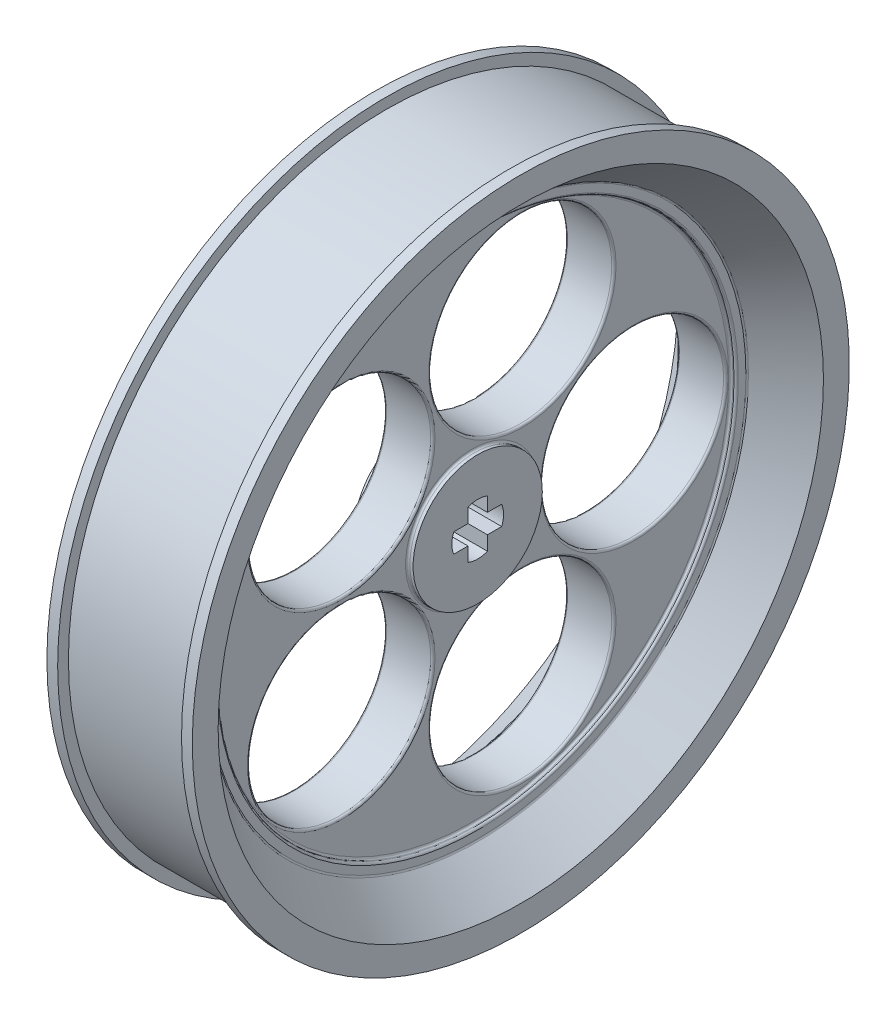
ISO-10303-21;
HEADER;
FILE_DESCRIPTION(('STEP AP214'),'2;1');
FILE_NAME('part.step','',(''),(''),'','','');
FILE_SCHEMA(('AUTOMOTIVE_DESIGN { 1 0 10303 214 1 1 1 1 }'));
ENDSEC;
DATA;
#1=APPLICATION_CONTEXT('core data for automotive mechanical design processes');
#2=APPLICATION_PROTOCOL_DEFINITION('international standard','automotive_design',2000,#1);
#3=PRODUCT_CONTEXT('',#1,'mechanical');
#4=PRODUCT('Part','Part','',(#3));
#5=PRODUCT_RELATED_PRODUCT_CATEGORY('part','',(#4));
#6=PRODUCT_DEFINITION_FORMATION('','',#4);
#7=PRODUCT_DEFINITION_CONTEXT('part definition',#1,'design');
#8=PRODUCT_DEFINITION('design','',#6,#7);
#9=PRODUCT_DEFINITION_SHAPE('','',#8);
#10=(LENGTH_UNIT() NAMED_UNIT(*) SI_UNIT(.MILLI.,.METRE.));
#11=(NAMED_UNIT(*) PLANE_ANGLE_UNIT() SI_UNIT($,.RADIAN.));
#12=(NAMED_UNIT(*) SI_UNIT($,.STERADIAN.) SOLID_ANGLE_UNIT());
#13=UNCERTAINTY_MEASURE_WITH_UNIT(LENGTH_MEASURE(1.E-05),#10,'distance_accuracy_value','');
#14=(GEOMETRIC_REPRESENTATION_CONTEXT(3) GLOBAL_UNCERTAINTY_ASSIGNED_CONTEXT((#13)) GLOBAL_UNIT_ASSIGNED_CONTEXT((#10,
#11,#12)) REPRESENTATION_CONTEXT('',''));
#15=CARTESIAN_POINT('',(0.,0.,0.));
#16=DIRECTION('',(0.,0.,1.));
#17=DIRECTION('',(1.,0.,0.));
#18=AXIS2_PLACEMENT_3D('',#15,#16,#17);
#19=CARTESIAN_POINT('',(2.75,25.,0.));
#20=DIRECTION('',(-1.,0.,0.));
#21=DIRECTION('',(0.,0.,1.));
#22=AXIS2_PLACEMENT_3D('',#19,#20,#21);
#23=PLANE('',#22);
#24=DIRECTION('',(0.,0.,-1.));
#25=VECTOR('',#24,1.);
#26=CARTESIAN_POINT('',(2.75,-0.9,2.2248595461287));
#27=LINE('',#26,#25);
#28=CARTESIAN_POINT('',(2.75,-0.900000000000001,2.2248595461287));
#29=VERTEX_POINT('',#28);
#30=CARTESIAN_POINT('',(2.75,-0.9,0.899999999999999));
#31=VERTEX_POINT('',#30);
#32=EDGE_CURVE('E137',#29,#31,#27,.T.);
#33=ORIENTED_EDGE('',*,*,#32,.F.);
#34=CARTESIAN_POINT('',(2.75,0.,0.));
#35=DIRECTION('',(1.,0.,0.));
#36=DIRECTION('',(0.,0.,-1.));
#37=AXIS2_PLACEMENT_3D('',#34,#35,#36);
#38=CIRCLE('',#37,2.4);
#39=CARTESIAN_POINT('',(2.75,0.9,2.2248595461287));
#40=VERTEX_POINT('',#39);
#41=EDGE_CURVE('E59',#40,#29,#38,.T.);
#42=ORIENTED_EDGE('',*,*,#41,.F.);
#43=DIRECTION('',(0.,0.,1.));
#44=VECTOR('',#43,1.);
#45=CARTESIAN_POINT('',(2.75,0.9,2.2248595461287));
#46=LINE('',#45,#44);
#47=CARTESIAN_POINT('',(2.75,0.9,0.899999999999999));
#48=VERTEX_POINT('',#47);
#49=EDGE_CURVE('E170',#48,#40,#46,.T.);
#50=ORIENTED_EDGE('',*,*,#49,.F.);
#51=DIRECTION('',(0.,-1.,0.));
#52=VECTOR('',#51,1.);
#53=CARTESIAN_POINT('',(2.75,2.2248595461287,0.9));
#54=LINE('',#53,#52);
#55=CARTESIAN_POINT('',(2.75,2.2248595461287,0.9));
#56=VERTEX_POINT('',#55);
#57=EDGE_CURVE('E167',#56,#48,#54,.T.);
#58=ORIENTED_EDGE('',*,*,#57,.F.);
#59=CARTESIAN_POINT('',(2.75,0.,0.));
#60=DIRECTION('',(1.,0.,0.));
#61=DIRECTION('',(0.,0.,-1.));
#62=AXIS2_PLACEMENT_3D('',#59,#60,#61);
#63=CIRCLE('',#62,2.4);
#64=CARTESIAN_POINT('',(2.75,2.2248595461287,-0.9));
#65=VERTEX_POINT('',#64);
#66=EDGE_CURVE('E164',#65,#56,#63,.T.);
#67=ORIENTED_EDGE('',*,*,#66,.F.);
#68=DIRECTION('',(0.,1.,0.));
#69=VECTOR('',#68,1.);
#70=CARTESIAN_POINT('',(2.75,2.2248595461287,-0.9));
#71=LINE('',#70,#69);
#72=CARTESIAN_POINT('',(2.75,0.9,-0.9));
#73=VERTEX_POINT('',#72);
#74=EDGE_CURVE('E161',#73,#65,#71,.T.);
#75=ORIENTED_EDGE('',*,*,#74,.F.);
#76=DIRECTION('',(0.,0.,1.));
#77=VECTOR('',#76,1.);
#78=CARTESIAN_POINT('',(2.75,0.9,-0.9));
#79=LINE('',#78,#77);
#80=CARTESIAN_POINT('',(2.75,0.9,-2.2248595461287));
#81=VERTEX_POINT('',#80);
#82=EDGE_CURVE('E158',#81,#73,#79,.T.);
#83=ORIENTED_EDGE('',*,*,#82,.F.);
#84=CARTESIAN_POINT('',(2.75,0.,0.));
#85=DIRECTION('',(1.,0.,0.));
#86=DIRECTION('',(0.,0.,-1.));
#87=AXIS2_PLACEMENT_3D('',#84,#85,#86);
#88=CIRCLE('',#87,2.4);
#89=CARTESIAN_POINT('',(2.75,-0.9,-2.2248595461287));
#90=VERTEX_POINT('',#89);
#91=EDGE_CURVE('E155',#90,#81,#88,.T.);
#92=ORIENTED_EDGE('',*,*,#91,.F.);
#93=DIRECTION('',(0.,0.,-1.));
#94=VECTOR('',#93,1.);
#95=CARTESIAN_POINT('',(2.75,-0.9,-0.9));
#96=LINE('',#95,#94);
#97=CARTESIAN_POINT('',(2.75,-0.9,-0.9));
#98=VERTEX_POINT('',#97);
#99=EDGE_CURVE('E152',#98,#90,#96,.T.);
#100=ORIENTED_EDGE('',*,*,#99,.F.);
#101=DIRECTION('',(0.,1.,0.));
#102=VECTOR('',#101,1.);
#103=CARTESIAN_POINT('',(2.75,-0.9,-0.9));
#104=LINE('',#103,#102);
#105=CARTESIAN_POINT('',(2.75,-2.2248595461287,-0.900000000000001));
#106=VERTEX_POINT('',#105);
#107=EDGE_CURVE('E146',#106,#98,#104,.T.);
#108=ORIENTED_EDGE('',*,*,#107,.F.);
#109=CARTESIAN_POINT('',(2.75,0.,0.));
#110=DIRECTION('',(1.,0.,0.));
#111=DIRECTION('',(0.,0.,-1.));
#112=AXIS2_PLACEMENT_3D('',#109,#110,#111);
#113=CIRCLE('',#112,2.4);
#114=CARTESIAN_POINT('',(2.75,-2.2248595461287,0.899999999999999));
#115=VERTEX_POINT('',#114);
#116=EDGE_CURVE('E144',#115,#106,#113,.T.);
#117=ORIENTED_EDGE('',*,*,#116,.F.);
#118=DIRECTION('',(0.,-1.,0.));
#119=VECTOR('',#118,1.);
#120=CARTESIAN_POINT('',(2.75,-0.9,0.899999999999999));
#121=LINE('',#120,#119);
#122=EDGE_CURVE('E128',#31,#115,#121,.T.);
#123=ORIENTED_EDGE('',*,*,#122,.F.);
#124=EDGE_LOOP('',(#33,#42,#50,#58,#67,#75,#83,#92,#100,#108,#117,#123));
#125=FACE_BOUND('',#124,.T.);
#126=CARTESIAN_POINT('',(2.75,0.,0.));
#127=DIRECTION('',(1.,0.,0.));
#128=DIRECTION('',(0.,0.,-1.));
#129=AXIS2_PLACEMENT_3D('',#126,#127,#128);
#130=CIRCLE('',#129,6.);
#131=CARTESIAN_POINT('',(2.75,0.,-6.));
#132=VERTEX_POINT('',#131);
#133=EDGE_CURVE('E898',#132,#132,#130,.T.);
#134=ORIENTED_EDGE('',*,*,#133,.T.);
#135=EDGE_LOOP('',(#134));
#136=FACE_BOUND('',#135,.T.);
#137=ADVANCED_FACE('F36',(#125,#136),#23,.F.);
#138=CARTESIAN_POINT('',(-2.75,0.,0.));
#139=DIRECTION('',(1.,0.,0.));
#140=DIRECTION('',(0.,0.,-1.));
#141=AXIS2_PLACEMENT_3D('',#138,#139,#140);
#142=PLANE('',#141);
#143=DIRECTION('',(0.,0.,1.));
#144=VECTOR('',#143,1.);
#145=CARTESIAN_POINT('',(-2.75,0.9,0.));
#146=LINE('',#145,#144);
#147=CARTESIAN_POINT('',(-2.75,0.9,0.899999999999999));
#148=VERTEX_POINT('',#147);
#149=CARTESIAN_POINT('',(-2.75,0.9,2.2248595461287));
#150=VERTEX_POINT('',#149);
#151=EDGE_CURVE('E220',#148,#150,#146,.T.);
#152=ORIENTED_EDGE('',*,*,#151,.T.);
#153=CARTESIAN_POINT('',(-2.75,0.,0.));
#154=DIRECTION('',(1.,0.,0.));
#155=DIRECTION('',(0.,0.,-1.));
#156=AXIS2_PLACEMENT_3D('',#153,#154,#155);
#157=CIRCLE('',#156,2.4);
#158=CARTESIAN_POINT('',(-2.75,-0.9,2.2248595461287));
#159=VERTEX_POINT('',#158);
#160=EDGE_CURVE('E223',#150,#159,#157,.T.);
#161=ORIENTED_EDGE('',*,*,#160,.T.);
#162=DIRECTION('',(0.,0.,-1.));
#163=VECTOR('',#162,1.);
#164=CARTESIAN_POINT('',(-2.75,-0.9,0.));
#165=LINE('',#164,#163);
#166=CARTESIAN_POINT('',(-2.75,-0.9,0.899999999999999));
#167=VERTEX_POINT('',#166);
#168=EDGE_CURVE('E175',#159,#167,#165,.T.);
#169=ORIENTED_EDGE('',*,*,#168,.T.);
#170=DIRECTION('',(0.,-1.,0.));
#171=VECTOR('',#170,1.);
#172=CARTESIAN_POINT('',(-2.75,0.,0.899999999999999));
#173=LINE('',#172,#171);
#174=CARTESIAN_POINT('',(-2.75,-2.2248595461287,0.899999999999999));
#175=VERTEX_POINT('',#174);
#176=EDGE_CURVE('E131',#167,#175,#173,.T.);
#177=ORIENTED_EDGE('',*,*,#176,.T.);
#178=CARTESIAN_POINT('',(-2.75,0.,0.));
#179=DIRECTION('',(1.,0.,0.));
#180=DIRECTION('',(0.,0.,-1.));
#181=AXIS2_PLACEMENT_3D('',#178,#179,#180);
#182=CIRCLE('',#181,2.4);
#183=CARTESIAN_POINT('',(-2.75,-2.2248595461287,-0.900000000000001));
#184=VERTEX_POINT('',#183);
#185=EDGE_CURVE('E196',#175,#184,#182,.T.);
#186=ORIENTED_EDGE('',*,*,#185,.T.);
#187=DIRECTION('',(0.,1.,0.));
#188=VECTOR('',#187,1.);
#189=CARTESIAN_POINT('',(-2.75,0.,-0.9));
#190=LINE('',#189,#188);
#191=CARTESIAN_POINT('',(-2.75,-0.9,-0.9));
#192=VERTEX_POINT('',#191);
#193=EDGE_CURVE('E199',#184,#192,#190,.T.);
#194=ORIENTED_EDGE('',*,*,#193,.T.);
#195=DIRECTION('',(0.,0.,-1.));
#196=VECTOR('',#195,1.);
#197=CARTESIAN_POINT('',(-2.75,-0.9,0.));
#198=LINE('',#197,#196);
#199=CARTESIAN_POINT('',(-2.75,-0.9,-2.2248595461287));
#200=VERTEX_POINT('',#199);
#201=EDGE_CURVE('E202',#192,#200,#198,.T.);
#202=ORIENTED_EDGE('',*,*,#201,.T.);
#203=CARTESIAN_POINT('',(-2.75,0.,0.));
#204=DIRECTION('',(1.,0.,0.));
#205=DIRECTION('',(0.,0.,-1.));
#206=AXIS2_PLACEMENT_3D('',#203,#204,#205);
#207=CIRCLE('',#206,2.4);
#208=CARTESIAN_POINT('',(-2.75,0.9,-2.2248595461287));
#209=VERTEX_POINT('',#208);
#210=EDGE_CURVE('E205',#200,#209,#207,.T.);
#211=ORIENTED_EDGE('',*,*,#210,.T.);
#212=DIRECTION('',(0.,0.,1.));
#213=VECTOR('',#212,1.);
#214=CARTESIAN_POINT('',(-2.75,0.9,0.));
#215=LINE('',#214,#213);
#216=CARTESIAN_POINT('',(-2.75,0.9,-0.9));
#217=VERTEX_POINT('',#216);
#218=EDGE_CURVE('E208',#209,#217,#215,.T.);
#219=ORIENTED_EDGE('',*,*,#218,.T.);
#220=DIRECTION('',(0.,1.,0.));
#221=VECTOR('',#220,1.);
#222=CARTESIAN_POINT('',(-2.75,0.,-0.9));
#223=LINE('',#222,#221);
#224=CARTESIAN_POINT('',(-2.75,2.2248595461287,-0.9));
#225=VERTEX_POINT('',#224);
#226=EDGE_CURVE('E211',#217,#225,#223,.T.);
#227=ORIENTED_EDGE('',*,*,#226,.T.);
#228=CARTESIAN_POINT('',(-2.75,0.,0.));
#229=DIRECTION('',(1.,0.,0.));
#230=DIRECTION('',(0.,0.,-1.));
#231=AXIS2_PLACEMENT_3D('',#228,#229,#230);
#232=CIRCLE('',#231,2.4);
#233=CARTESIAN_POINT('',(-2.75,2.2248595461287,0.9));
#234=VERTEX_POINT('',#233);
#235=EDGE_CURVE('E214',#225,#234,#232,.T.);
#236=ORIENTED_EDGE('',*,*,#235,.T.);
#237=DIRECTION('',(0.,-1.,0.));
#238=VECTOR('',#237,1.);
#239=CARTESIAN_POINT('',(-2.75,0.,0.899999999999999));
#240=LINE('',#239,#238);
#241=EDGE_CURVE('E217',#234,#148,#240,.T.);
#242=ORIENTED_EDGE('',*,*,#241,.T.);
#243=EDGE_LOOP('',(#152,#161,#169,#177,#186,#194,#202,#211,#219,#227,#236,#242));
#244=FACE_BOUND('',#243,.T.);
#245=CARTESIAN_POINT('',(-2.75,0.,0.));
#246=DIRECTION('',(-1.,0.,0.));
#247=DIRECTION('',(0.,0.,1.));
#248=AXIS2_PLACEMENT_3D('',#245,#246,#247);
#249=CIRCLE('',#248,6.);
#250=CARTESIAN_POINT('',(-2.75,0.,6.));
#251=VERTEX_POINT('',#250);
#252=EDGE_CURVE('E894',#251,#251,#249,.T.);
#253=ORIENTED_EDGE('',*,*,#252,.T.);
#254=EDGE_LOOP('',(#253));
#255=FACE_BOUND('',#254,.T.);
#256=ADVANCED_FACE('F376',(#244,#255),#142,.F.);
#257=CARTESIAN_POINT('',(-2.75,0.,0.));
#258=DIRECTION('',(1.,0.,0.));
#259=DIRECTION('',(0.,0.,-1.));
#260=AXIS2_PLACEMENT_3D('',#257,#258,#259);
#261=CIRCLE('',#260,24.2);
#262=CARTESIAN_POINT('',(-2.75,0.,-24.2));
#263=VERTEX_POINT('',#262);
#264=EDGE_CURVE('E325',#263,#263,#261,.T.);
#265=ORIENTED_EDGE('',*,*,#264,.T.);
#266=EDGE_LOOP('',(#265));
#267=FACE_BOUND('',#266,.T.);
#268=CARTESIAN_POINT('',(-2.75,0.,0.));
#269=DIRECTION('',(1.,0.,0.));
#270=DIRECTION('',(0.,0.,-1.));
#271=AXIS2_PLACEMENT_3D('',#268,#269,#270);
#272=CIRCLE('',#271,24.9019683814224);
#273=CARTESIAN_POINT('',(-2.75,0.,-24.9019683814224));
#274=VERTEX_POINT('',#273);
#275=EDGE_CURVE('E322',#274,#274,#272,.F.);
#276=ORIENTED_EDGE('',*,*,#275,.T.);
#277=EDGE_LOOP('',(#276));
#278=FACE_BOUND('',#277,.T.);
#279=ADVANCED_FACE('F382',(#267,#278),#142,.F.);
#280=CARTESIAN_POINT('',(-6.75000000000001,0.,0.));
#281=DIRECTION('',(-1.,0.,0.));
#282=DIRECTION('',(0.,0.,1.));
#283=AXIS2_PLACEMENT_3D('',#280,#281,#282);
#284=CONICAL_SURFACE('',#283,28.1,0.659310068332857);
#285=CARTESIAN_POINT('',(-2.82748566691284,0.,0.));
#286=DIRECTION('',(-1.,0.,0.));
#287=DIRECTION('',(0.,0.,1.));
#288=AXIS2_PLACEMENT_3D('',#285,#286,#287);
#289=CIRCLE('',#288,25.0600513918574);
#290=CARTESIAN_POINT('',(-2.82748566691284,0.,25.0600513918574));
#291=VERTEX_POINT('',#290);
#292=EDGE_CURVE('E328',#291,#291,#289,.F.);
#293=ORIENTED_EDGE('',*,*,#292,.T.);
#294=EDGE_LOOP('',(#293));
#295=FACE_BOUND('',#294,.T.);
#296=CARTESIAN_POINT('',(-6.75000000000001,0.,0.));
#297=DIRECTION('',(-1.,0.,0.));
#298=DIRECTION('',(0.,0.,1.));
#299=AXIS2_PLACEMENT_3D('',#296,#297,#298);
#300=CIRCLE('',#299,28.1);
#301=CARTESIAN_POINT('',(-6.75000000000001,0.,28.1));
#302=VERTEX_POINT('',#301);
#303=EDGE_CURVE('E247',#302,#302,#300,.T.);
#304=ORIENTED_EDGE('',*,*,#303,.T.);
#305=EDGE_LOOP('',(#304));
#306=FACE_BOUND('',#305,.T.);
#307=ADVANCED_FACE('F441',(#295,#306),#284,.F.);
#308=CARTESIAN_POINT('',(-6.75,28.1,0.));
#309=DIRECTION('',(1.,0.,0.));
#310=DIRECTION('',(0.,0.,-1.));
#311=AXIS2_PLACEMENT_3D('',#308,#309,#310);
#312=PLANE('',#311);
#313=ORIENTED_EDGE('',*,*,#303,.F.);
#314=EDGE_LOOP('',(#313));
#315=FACE_BOUND('',#314,.T.);
#316=CARTESIAN_POINT('',(-6.75000000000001,0.,0.));
#317=DIRECTION('',(-1.,0.,0.));
#318=DIRECTION('',(0.,0.,1.));
#319=AXIS2_PLACEMENT_3D('',#316,#317,#318);
#320=CIRCLE('',#319,30.5);
#321=CARTESIAN_POINT('',(-6.75000000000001,0.,30.5));
#322=VERTEX_POINT('',#321);
#323=EDGE_CURVE('E244',#322,#322,#320,.T.);
#324=ORIENTED_EDGE('',*,*,#323,.T.);
#325=EDGE_LOOP('',(#324));
#326=FACE_BOUND('',#325,.T.);
#327=ADVANCED_FACE('F437',(#315,#326),#312,.F.);
#328=CARTESIAN_POINT('',(-106.362451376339,0.,0.));
#329=DIRECTION('',(-1.,0.,0.));
#330=DIRECTION('',(0.,0.,1.));
#331=AXIS2_PLACEMENT_3D('',#328,#329,#330);
#332=CYLINDRICAL_SURFACE('',#331,30.5);
#333=ORIENTED_EDGE('',*,*,#323,.F.);
#334=EDGE_LOOP('',(#333));
#335=FACE_BOUND('',#334,.T.);
#336=CARTESIAN_POINT('',(-5.75000000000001,0.,0.));
#337=DIRECTION('',(-1.,0.,0.));
#338=DIRECTION('',(0.,0.,1.));
#339=AXIS2_PLACEMENT_3D('',#336,#337,#338);
#340=CIRCLE('',#339,30.5);
#341=CARTESIAN_POINT('',(-5.75000000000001,0.,30.5));
#342=VERTEX_POINT('',#341);
#343=EDGE_CURVE('E241',#342,#342,#340,.T.);
#344=ORIENTED_EDGE('',*,*,#343,.T.);
#345=EDGE_LOOP('',(#344));
#346=FACE_BOUND('',#345,.T.);
#347=ADVANCED_FACE('F433',(#335,#346),#332,.T.);
#348=CARTESIAN_POINT('',(-5.75,30.5,0.));
#349=DIRECTION('',(-1.,0.,0.));
#350=DIRECTION('',(0.,0.,1.));
#351=AXIS2_PLACEMENT_3D('',#348,#349,#350);
#352=PLANE('',#351);
#353=ORIENTED_EDGE('',*,*,#343,.F.);
#354=EDGE_LOOP('',(#353));
#355=FACE_BOUND('',#354,.T.);
#356=CARTESIAN_POINT('',(-5.75000000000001,0.,0.));
#357=DIRECTION('',(-1.,0.,0.));
#358=DIRECTION('',(0.,0.,1.));
#359=AXIS2_PLACEMENT_3D('',#356,#357,#358);
#360=CIRCLE('',#359,29.5);
#361=CARTESIAN_POINT('',(-5.75000000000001,0.,29.5));
#362=VERTEX_POINT('',#361);
#363=EDGE_CURVE('E238',#362,#362,#360,.T.);
#364=ORIENTED_EDGE('',*,*,#363,.T.);
#365=EDGE_LOOP('',(#364));
#366=FACE_BOUND('',#365,.T.);
#367=ADVANCED_FACE('F429',(#355,#366),#352,.F.);
#368=CARTESIAN_POINT('',(-106.362451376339,0.,0.));
#369=DIRECTION('',(-1.,0.,0.));
#370=DIRECTION('',(0.,0.,1.));
#371=AXIS2_PLACEMENT_3D('',#368,#369,#370);
#372=CYLINDRICAL_SURFACE('',#371,29.5);
#373=ORIENTED_EDGE('',*,*,#363,.F.);
#374=EDGE_LOOP('',(#373));
#375=FACE_BOUND('',#374,.T.);
#376=CARTESIAN_POINT('',(5.74999999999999,0.,0.));
#377=DIRECTION('',(-1.,0.,0.));
#378=DIRECTION('',(0.,0.,1.));
#379=AXIS2_PLACEMENT_3D('',#376,#377,#378);
#380=CIRCLE('',#379,29.5);
#381=CARTESIAN_POINT('',(5.74999999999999,0.,29.5));
#382=VERTEX_POINT('',#381);
#383=EDGE_CURVE('E235',#382,#382,#380,.T.);
#384=ORIENTED_EDGE('',*,*,#383,.T.);
#385=EDGE_LOOP('',(#384));
#386=FACE_BOUND('',#385,.T.);
#387=ADVANCED_FACE('F425',(#375,#386),#372,.T.);
#388=CARTESIAN_POINT('',(5.75,29.5,0.));
#389=DIRECTION('',(1.,0.,0.));
#390=DIRECTION('',(0.,0.,-1.));
#391=AXIS2_PLACEMENT_3D('',#388,#389,#390);
#392=PLANE('',#391);
#393=ORIENTED_EDGE('',*,*,#383,.F.);
#394=EDGE_LOOP('',(#393));
#395=FACE_BOUND('',#394,.T.);
#396=CARTESIAN_POINT('',(5.74999999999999,0.,0.));
#397=DIRECTION('',(-1.,0.,0.));
#398=DIRECTION('',(0.,0.,1.));
#399=AXIS2_PLACEMENT_3D('',#396,#397,#398);
#400=CIRCLE('',#399,30.5);
#401=CARTESIAN_POINT('',(5.74999999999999,0.,30.5));
#402=VERTEX_POINT('',#401);
#403=EDGE_CURVE('E232',#402,#402,#400,.T.);
#404=ORIENTED_EDGE('',*,*,#403,.T.);
#405=EDGE_LOOP('',(#404));
#406=FACE_BOUND('',#405,.T.);
#407=ADVANCED_FACE('F418',(#395,#406),#392,.F.);
#408=CARTESIAN_POINT('',(-106.362451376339,0.,0.));
#409=DIRECTION('',(-1.,0.,0.));
#410=DIRECTION('',(0.,0.,1.));
#411=AXIS2_PLACEMENT_3D('',#408,#409,#410);
#412=CYLINDRICAL_SURFACE('',#411,30.5);
#413=ORIENTED_EDGE('',*,*,#403,.F.);
#414=EDGE_LOOP('',(#413));
#415=FACE_BOUND('',#414,.T.);
#416=CARTESIAN_POINT('',(6.74999999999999,0.,0.));
#417=DIRECTION('',(-1.,0.,0.));
#418=DIRECTION('',(0.,0.,1.));
#419=AXIS2_PLACEMENT_3D('',#416,#417,#418);
#420=CIRCLE('',#419,30.5);
#421=CARTESIAN_POINT('',(6.74999999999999,0.,30.5));
#422=VERTEX_POINT('',#421);
#423=EDGE_CURVE('E229',#422,#422,#420,.T.);
#424=ORIENTED_EDGE('',*,*,#423,.T.);
#425=EDGE_LOOP('',(#424));
#426=FACE_BOUND('',#425,.T.);
#427=ADVANCED_FACE('F412',(#415,#426),#412,.T.);
#428=CARTESIAN_POINT('',(6.75,30.5,0.));
#429=DIRECTION('',(-1.,0.,0.));
#430=DIRECTION('',(0.,0.,1.));
#431=AXIS2_PLACEMENT_3D('',#428,#429,#430);
#432=PLANE('',#431);
#433=ORIENTED_EDGE('',*,*,#423,.F.);
#434=EDGE_LOOP('',(#433));
#435=FACE_BOUND('',#434,.T.);
#436=CARTESIAN_POINT('',(6.74999999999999,0.,0.));
#437=DIRECTION('',(-1.,0.,0.));
#438=DIRECTION('',(0.,0.,1.));
#439=AXIS2_PLACEMENT_3D('',#436,#437,#438);
#440=CIRCLE('',#439,28.1);
#441=CARTESIAN_POINT('',(6.74999999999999,0.,28.1));
#442=VERTEX_POINT('',#441);
#443=EDGE_CURVE('E226',#442,#442,#440,.T.);
#444=ORIENTED_EDGE('',*,*,#443,.T.);
#445=EDGE_LOOP('',(#444));
#446=FACE_BOUND('',#445,.T.);
#447=ADVANCED_FACE('F396',(#435,#446),#432,.F.);
#448=CARTESIAN_POINT('',(2.75,0.,0.));
#449=DIRECTION('',(1.,0.,0.));
#450=DIRECTION('',(0.,0.,-1.));
#451=AXIS2_PLACEMENT_3D('',#448,#449,#450);
#452=CONICAL_SURFACE('',#451,25.,0.659310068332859);
#453=CARTESIAN_POINT('',(2.82748566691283,0.,0.));
#454=DIRECTION('',(1.,0.,0.));
#455=DIRECTION('',(0.,0.,-1.));
#456=AXIS2_PLACEMENT_3D('',#453,#454,#455);
#457=CIRCLE('',#456,25.0600513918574);
#458=CARTESIAN_POINT('',(2.82748566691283,0.,-25.0600513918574));
#459=VERTEX_POINT('',#458);
#460=EDGE_CURVE('E265',#459,#459,#457,.F.);
#461=ORIENTED_EDGE('',*,*,#460,.T.);
#462=EDGE_LOOP('',(#461));
#463=FACE_BOUND('',#462,.T.);
#464=ORIENTED_EDGE('',*,*,#443,.F.);
#465=EDGE_LOOP('',(#464));
#466=FACE_BOUND('',#465,.T.);
#467=ADVANCED_FACE('F389',(#463,#466),#452,.F.);
#468=CARTESIAN_POINT('',(2.75,0.,0.));
#469=DIRECTION('',(-1.,0.,0.));
#470=DIRECTION('',(0.,0.,1.));
#471=AXIS2_PLACEMENT_3D('',#468,#469,#470);
#472=CIRCLE('',#471,24.2);
#473=CARTESIAN_POINT('',(2.75,0.,24.2));
#474=VERTEX_POINT('',#473);
#475=EDGE_CURVE('E259',#474,#474,#472,.T.);
#476=ORIENTED_EDGE('',*,*,#475,.T.);
#477=EDGE_LOOP('',(#476));
#478=FACE_BOUND('',#477,.T.);
#479=CARTESIAN_POINT('',(2.75,0.,0.));
#480=DIRECTION('',(-1.,0.,0.));
#481=DIRECTION('',(0.,0.,1.));
#482=AXIS2_PLACEMENT_3D('',#479,#480,#481);
#483=CIRCLE('',#482,24.9019683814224);
#484=CARTESIAN_POINT('',(2.75,0.,24.9019683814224));
#485=VERTEX_POINT('',#484);
#486=EDGE_CURVE('E256',#485,#485,#483,.F.);
#487=ORIENTED_EDGE('',*,*,#486,.T.);
#488=EDGE_LOOP('',(#487));
#489=FACE_BOUND('',#488,.T.);
#490=ADVANCED_FACE('F378',(#478,#489),#23,.F.);
#491=CARTESIAN_POINT('',(-6.75,0.,0.));
#492=DIRECTION('',(1.,0.,0.));
#493=DIRECTION('',(0.,0.,-1.));
#494=AXIS2_PLACEMENT_3D('',#491,#492,#493);
#495=CYLINDRICAL_SURFACE('',#494,2.4);
#496=DIRECTION('',(1.,0.,0.));
#497=VECTOR('',#496,1.);
#498=CARTESIAN_POINT('',(-6.75,0.9,2.2248595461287));
#499=LINE('',#498,#497);
#500=EDGE_CURVE('E173',#150,#40,#499,.T.);
#501=ORIENTED_EDGE('',*,*,#500,.T.);
#502=ORIENTED_EDGE('',*,*,#41,.T.);
#503=DIRECTION('',(1.,0.,0.));
#504=VECTOR('',#503,1.);
#505=CARTESIAN_POINT('',(-6.75,-0.9,2.2248595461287));
#506=LINE('',#505,#504);
#507=EDGE_CURVE('E134',#159,#29,#506,.T.);
#508=ORIENTED_EDGE('',*,*,#507,.F.);
#509=ORIENTED_EDGE('',*,*,#160,.F.);
#510=EDGE_LOOP('',(#501,#502,#508,#509));
#511=FACE_BOUND('',#510,.T.);
#512=ADVANCED_FACE('F388',(#511),#495,.F.);
#513=CARTESIAN_POINT('',(-6.75,0.9,2.2248595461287));
#514=DIRECTION('',(0.,1.,0.));
#515=DIRECTION('',(0.,0.,1.));
#516=AXIS2_PLACEMENT_3D('',#513,#514,#515);
#517=PLANE('',#516);
#518=DIRECTION('',(1.,0.,0.));
#519=VECTOR('',#518,1.);
#520=CARTESIAN_POINT('',(-6.75,0.9,0.899999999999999));
#521=LINE('',#520,#519);
#522=EDGE_CURVE('E176',#148,#48,#521,.T.);
#523=ORIENTED_EDGE('',*,*,#522,.T.);
#524=ORIENTED_EDGE('',*,*,#49,.T.);
#525=ORIENTED_EDGE('',*,*,#500,.F.);
#526=ORIENTED_EDGE('',*,*,#151,.F.);
#527=EDGE_LOOP('',(#523,#524,#525,#526));
#528=FACE_BOUND('',#527,.T.);
#529=ADVANCED_FACE('F395',(#528),#517,.F.);
#530=CARTESIAN_POINT('',(-6.75,2.2248595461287,0.9));
#531=DIRECTION('',(0.,0.,1.));
#532=DIRECTION('',(0.,-1.,0.));
#533=AXIS2_PLACEMENT_3D('',#530,#531,#532);
#534=PLANE('',#533);
#535=DIRECTION('',(1.,0.,0.));
#536=VECTOR('',#535,1.);
#537=CARTESIAN_POINT('',(-6.75,2.2248595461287,0.9));
#538=LINE('',#537,#536);
#539=EDGE_CURVE('E178',#234,#56,#538,.T.);
#540=ORIENTED_EDGE('',*,*,#539,.T.);
#541=ORIENTED_EDGE('',*,*,#57,.T.);
#542=ORIENTED_EDGE('',*,*,#522,.F.);
#543=ORIENTED_EDGE('',*,*,#241,.F.);
#544=EDGE_LOOP('',(#540,#541,#542,#543));
#545=FACE_BOUND('',#544,.T.);
#546=ADVANCED_FACE('F540',(#545),#534,.F.);
#547=CARTESIAN_POINT('',(-6.75,0.,0.));
#548=DIRECTION('',(1.,0.,0.));
#549=DIRECTION('',(0.,0.,-1.));
#550=AXIS2_PLACEMENT_3D('',#547,#548,#549);
#551=CYLINDRICAL_SURFACE('',#550,2.4);
#552=DIRECTION('',(1.,0.,0.));
#553=VECTOR('',#552,1.);
#554=CARTESIAN_POINT('',(-6.75,2.2248595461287,-0.9));
#555=LINE('',#554,#553);
#556=EDGE_CURVE('E180',#225,#65,#555,.T.);
#557=ORIENTED_EDGE('',*,*,#556,.T.);
#558=ORIENTED_EDGE('',*,*,#66,.T.);
#559=ORIENTED_EDGE('',*,*,#539,.F.);
#560=ORIENTED_EDGE('',*,*,#235,.F.);
#561=EDGE_LOOP('',(#557,#558,#559,#560));
#562=FACE_BOUND('',#561,.T.);
#563=ADVANCED_FACE('F544',(#562),#551,.F.);
#564=CARTESIAN_POINT('',(-6.75,2.2248595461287,-0.9));
#565=DIRECTION('',(0.,0.,-1.));
#566=DIRECTION('',(0.,1.,0.));
#567=AXIS2_PLACEMENT_3D('',#564,#565,#566);
#568=PLANE('',#567);
#569=DIRECTION('',(1.,0.,0.));
#570=VECTOR('',#569,1.);
#571=CARTESIAN_POINT('',(-6.75,0.9,-0.9));
#572=LINE('',#571,#570);
#573=EDGE_CURVE('E182',#217,#73,#572,.T.);
#574=ORIENTED_EDGE('',*,*,#573,.T.);
#575=ORIENTED_EDGE('',*,*,#74,.T.);
#576=ORIENTED_EDGE('',*,*,#556,.F.);
#577=ORIENTED_EDGE('',*,*,#226,.F.);
#578=EDGE_LOOP('',(#574,#575,#576,#577));
#579=FACE_BOUND('',#578,.T.);
#580=ADVANCED_FACE('F548',(#579),#568,.F.);
#581=CARTESIAN_POINT('',(-6.75,0.9,-0.9));
#582=DIRECTION('',(0.,1.,0.));
#583=DIRECTION('',(0.,0.,1.));
#584=AXIS2_PLACEMENT_3D('',#581,#582,#583);
#585=PLANE('',#584);
#586=DIRECTION('',(1.,0.,0.));
#587=VECTOR('',#586,1.);
#588=CARTESIAN_POINT('',(-6.75,0.9,-2.2248595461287));
#589=LINE('',#588,#587);
#590=EDGE_CURVE('E184',#209,#81,#589,.T.);
#591=ORIENTED_EDGE('',*,*,#590,.T.);
#592=ORIENTED_EDGE('',*,*,#82,.T.);
#593=ORIENTED_EDGE('',*,*,#573,.F.);
#594=ORIENTED_EDGE('',*,*,#218,.F.);
#595=EDGE_LOOP('',(#591,#592,#593,#594));
#596=FACE_BOUND('',#595,.T.);
#597=ADVANCED_FACE('F552',(#596),#585,.F.);
#598=CARTESIAN_POINT('',(-6.75,0.,0.));
#599=DIRECTION('',(1.,0.,0.));
#600=DIRECTION('',(0.,0.,-1.));
#601=AXIS2_PLACEMENT_3D('',#598,#599,#600);
#602=CYLINDRICAL_SURFACE('',#601,2.4);
#603=DIRECTION('',(1.,0.,0.));
#604=VECTOR('',#603,1.);
#605=CARTESIAN_POINT('',(-6.75,-0.9,-2.2248595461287));
#606=LINE('',#605,#604);
#607=EDGE_CURVE('E186',#200,#90,#606,.T.);
#608=ORIENTED_EDGE('',*,*,#607,.T.);
#609=ORIENTED_EDGE('',*,*,#91,.T.);
#610=ORIENTED_EDGE('',*,*,#590,.F.);
#611=ORIENTED_EDGE('',*,*,#210,.F.);
#612=EDGE_LOOP('',(#608,#609,#610,#611));
#613=FACE_BOUND('',#612,.T.);
#614=ADVANCED_FACE('F556',(#613),#602,.F.);
#615=CARTESIAN_POINT('',(-6.75,-0.9,-0.9));
#616=DIRECTION('',(0.,-1.,0.));
#617=DIRECTION('',(0.,0.,-1.));
#618=AXIS2_PLACEMENT_3D('',#615,#616,#617);
#619=PLANE('',#618);
#620=DIRECTION('',(1.,0.,0.));
#621=VECTOR('',#620,1.);
#622=CARTESIAN_POINT('',(-6.75,-0.9,-0.9));
#623=LINE('',#622,#621);
#624=EDGE_CURVE('E188',#192,#98,#623,.T.);
#625=ORIENTED_EDGE('',*,*,#624,.T.);
#626=ORIENTED_EDGE('',*,*,#99,.T.);
#627=ORIENTED_EDGE('',*,*,#607,.F.);
#628=ORIENTED_EDGE('',*,*,#201,.F.);
#629=EDGE_LOOP('',(#625,#626,#627,#628));
#630=FACE_BOUND('',#629,.T.);
#631=ADVANCED_FACE('F560',(#630),#619,.F.);
#632=CARTESIAN_POINT('',(-6.75,-0.9,-0.9));
#633=DIRECTION('',(0.,0.,-1.));
#634=DIRECTION('',(0.,1.,0.));
#635=AXIS2_PLACEMENT_3D('',#632,#633,#634);
#636=PLANE('',#635);
#637=DIRECTION('',(1.,0.,0.));
#638=VECTOR('',#637,1.);
#639=CARTESIAN_POINT('',(-6.75,-2.2248595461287,-0.900000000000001));
#640=LINE('',#639,#638);
#641=EDGE_CURVE('E190',#184,#106,#640,.T.);
#642=ORIENTED_EDGE('',*,*,#641,.T.);
#643=ORIENTED_EDGE('',*,*,#107,.T.);
#644=ORIENTED_EDGE('',*,*,#624,.F.);
#645=ORIENTED_EDGE('',*,*,#193,.F.);
#646=EDGE_LOOP('',(#642,#643,#644,#645));
#647=FACE_BOUND('',#646,.T.);
#648=ADVANCED_FACE('F564',(#647),#636,.F.);
#649=CARTESIAN_POINT('',(-6.75,0.,0.));
#650=DIRECTION('',(1.,0.,0.));
#651=DIRECTION('',(0.,0.,-1.));
#652=AXIS2_PLACEMENT_3D('',#649,#650,#651);
#653=CYLINDRICAL_SURFACE('',#652,2.4);
#654=DIRECTION('',(1.,0.,0.));
#655=VECTOR('',#654,1.);
#656=CARTESIAN_POINT('',(-6.75,-2.2248595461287,0.899999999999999));
#657=LINE('',#656,#655);
#658=EDGE_CURVE('E133',#175,#115,#657,.T.);
#659=ORIENTED_EDGE('',*,*,#658,.T.);
#660=ORIENTED_EDGE('',*,*,#116,.T.);
#661=ORIENTED_EDGE('',*,*,#641,.F.);
#662=ORIENTED_EDGE('',*,*,#185,.F.);
#663=EDGE_LOOP('',(#659,#660,#661,#662));
#664=FACE_BOUND('',#663,.T.);
#665=ADVANCED_FACE('F568',(#664),#653,.F.);
#666=CARTESIAN_POINT('',(-6.75,-0.9,0.899999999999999));
#667=DIRECTION('',(0.,0.,1.));
#668=DIRECTION('',(0.,-1.,0.));
#669=AXIS2_PLACEMENT_3D('',#666,#667,#668);
#670=PLANE('',#669);
#671=DIRECTION('',(1.,0.,0.));
#672=VECTOR('',#671,1.);
#673=CARTESIAN_POINT('',(-6.75,-0.9,0.899999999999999));
#674=LINE('',#673,#672);
#675=EDGE_CURVE('E51',#167,#31,#674,.T.);
#676=ORIENTED_EDGE('',*,*,#675,.T.);
#677=ORIENTED_EDGE('',*,*,#122,.T.);
#678=ORIENTED_EDGE('',*,*,#658,.F.);
#679=ORIENTED_EDGE('',*,*,#176,.F.);
#680=EDGE_LOOP('',(#676,#677,#678,#679));
#681=FACE_BOUND('',#680,.T.);
#682=ADVANCED_FACE('F125',(#681),#670,.F.);
#683=CARTESIAN_POINT('',(-6.75,-0.9,2.2248595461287));
#684=DIRECTION('',(0.,-1.,0.));
#685=DIRECTION('',(0.,0.,-1.));
#686=AXIS2_PLACEMENT_3D('',#683,#684,#685);
#687=PLANE('',#686);
#688=ORIENTED_EDGE('',*,*,#507,.T.);
#689=ORIENTED_EDGE('',*,*,#32,.T.);
#690=ORIENTED_EDGE('',*,*,#675,.F.);
#691=ORIENTED_EDGE('',*,*,#168,.F.);
#692=EDGE_LOOP('',(#688,#689,#690,#691));
#693=FACE_BOUND('',#692,.T.);
#694=ADVANCED_FACE('F138',(#693),#687,.F.);
#695=CARTESIAN_POINT('',(-2.25,0.,0.));
#696=DIRECTION('',(-1.,0.,0.));
#697=DIRECTION('',(0.,0.,1.));
#698=AXIS2_PLACEMENT_3D('',#695,#696,#697);
#699=CYLINDRICAL_SURFACE('',#698,24.);
#700=CARTESIAN_POINT('',(-2.45,0.,0.));
#701=DIRECTION('',(-1.,0.,0.));
#702=DIRECTION('',(0.,0.,1.));
#703=AXIS2_PLACEMENT_3D('',#700,#701,#702);
#704=CIRCLE('',#703,24.);
#705=CARTESIAN_POINT('',(-2.45,0.,24.));
#706=VERTEX_POINT('',#705);
#707=EDGE_CURVE('E319',#706,#706,#704,.F.);
#708=ORIENTED_EDGE('',*,*,#707,.T.);
#709=EDGE_LOOP('',(#708));
#710=FACE_BOUND('',#709,.T.);
#711=CARTESIAN_POINT('',(-2.55,0.,0.));
#712=DIRECTION('',(1.,0.,0.));
#713=DIRECTION('',(0.,0.,-1.));
#714=AXIS2_PLACEMENT_3D('',#711,#712,#713);
#715=CIRCLE('',#714,24.);
#716=CARTESIAN_POINT('',(-2.55,0.,-24.));
#717=VERTEX_POINT('',#716);
#718=EDGE_CURVE('E316',#717,#717,#715,.F.);
#719=ORIENTED_EDGE('',*,*,#718,.T.);
#720=EDGE_LOOP('',(#719));
#721=FACE_BOUND('',#720,.T.);
#722=ADVANCED_FACE('F533',(#710,#721),#699,.F.);
#723=CARTESIAN_POINT('',(-2.25,0.,0.));
#724=DIRECTION('',(-1.,0.,0.));
#725=DIRECTION('',(0.,0.,1.));
#726=AXIS2_PLACEMENT_3D('',#723,#724,#725);
#727=PLANE('',#726);
#728=CARTESIAN_POINT('',(-2.25,-14.2980674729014,-4.64572374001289));
#729=DIRECTION('',(-1.,0.,0.));
#730=DIRECTION('',(0.,0.,1.));
#731=AXIS2_PLACEMENT_3D('',#728,#729,#730);
#732=CIRCLE('',#731,8.7);
#733=CARTESIAN_POINT('',(-2.25,-14.2980674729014,4.05427625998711));
#734=VERTEX_POINT('',#733);
#735=EDGE_CURVE('E289',#734,#734,#732,.F.);
#736=ORIENTED_EDGE('',*,*,#735,.T.);
#737=EDGE_LOOP('',(#736));
#738=FACE_BOUND('',#737,.T.);
#739=CARTESIAN_POINT('',(-2.25,-8.83669167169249,12.1626626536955));
#740=DIRECTION('',(-1.,0.,0.));
#741=DIRECTION('',(0.,0.,1.));
#742=AXIS2_PLACEMENT_3D('',#739,#740,#741);
#743=CIRCLE('',#742,8.7);
#744=CARTESIAN_POINT('',(-2.25,-8.83669167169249,20.8626626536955));
#745=VERTEX_POINT('',#744);
#746=EDGE_CURVE('E286',#745,#745,#743,.F.);
#747=ORIENTED_EDGE('',*,*,#746,.T.);
#748=EDGE_LOOP('',(#747));
#749=FACE_BOUND('',#748,.T.);
#750=CARTESIAN_POINT('',(-2.25,8.83669167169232,12.1626626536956));
#751=DIRECTION('',(-1.,0.,0.));
#752=DIRECTION('',(0.,0.,1.));
#753=AXIS2_PLACEMENT_3D('',#750,#751,#752);
#754=CIRCLE('',#753,8.7);
#755=CARTESIAN_POINT('',(-2.25,8.83669167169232,20.8626626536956));
#756=VERTEX_POINT('',#755);
#757=EDGE_CURVE('E283',#756,#756,#754,.F.);
#758=ORIENTED_EDGE('',*,*,#757,.T.);
#759=EDGE_LOOP('',(#758));
#760=FACE_BOUND('',#759,.T.);
#761=CARTESIAN_POINT('',(-2.25,0.,-15.0338778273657));
#762=DIRECTION('',(-1.,0.,0.));
#763=DIRECTION('',(0.,0.,1.));
#764=AXIS2_PLACEMENT_3D('',#761,#762,#763);
#765=CIRCLE('',#764,8.7);
#766=CARTESIAN_POINT('',(-2.25,0.,-6.33387782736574));
#767=VERTEX_POINT('',#766);
#768=EDGE_CURVE('E280',#767,#767,#765,.F.);
#769=ORIENTED_EDGE('',*,*,#768,.T.);
#770=EDGE_LOOP('',(#769));
#771=FACE_BOUND('',#770,.T.);
#772=CARTESIAN_POINT('',(-2.25,14.2980674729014,-4.64572374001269));
#773=DIRECTION('',(-1.,0.,0.));
#774=DIRECTION('',(0.,0.,1.));
#775=AXIS2_PLACEMENT_3D('',#772,#773,#774);
#776=CIRCLE('',#775,8.7);
#777=CARTESIAN_POINT('',(-2.25,14.2980674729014,4.05427625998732));
#778=VERTEX_POINT('',#777);
#779=EDGE_CURVE('E277',#778,#778,#776,.F.);
#780=ORIENTED_EDGE('',*,*,#779,.T.);
#781=EDGE_LOOP('',(#780));
#782=FACE_BOUND('',#781,.T.);
#783=CARTESIAN_POINT('',(-2.25,0.,0.));
#784=DIRECTION('',(-1.,0.,0.));
#785=DIRECTION('',(0.,0.,1.));
#786=AXIS2_PLACEMENT_3D('',#783,#784,#785);
#787=CIRCLE('',#786,23.8);
#788=CARTESIAN_POINT('',(-2.25,0.,23.8));
#789=VERTEX_POINT('',#788);
#790=EDGE_CURVE('E274',#789,#789,#787,.T.);
#791=ORIENTED_EDGE('',*,*,#790,.T.);
#792=EDGE_LOOP('',(#791));
#793=FACE_BOUND('',#792,.T.);
#794=CARTESIAN_POINT('',(-2.25,0.,0.));
#795=DIRECTION('',(-1.,0.,0.));
#796=DIRECTION('',(0.,0.,1.));
#797=AXIS2_PLACEMENT_3D('',#794,#795,#796);
#798=CIRCLE('',#797,6.);
#799=CARTESIAN_POINT('',(-2.25,0.,6.));
#800=VERTEX_POINT('',#799);
#801=EDGE_CURVE('E892',#800,#800,#798,.T.);
#802=ORIENTED_EDGE('',*,*,#801,.F.);
#803=EDGE_LOOP('',(#802));
#804=FACE_BOUND('',#803,.T.);
#805=ADVANCED_FACE('F529',(#738,#749,#760,#771,#782,#793,#804),#727,.T.);
#806=CARTESIAN_POINT('',(-2.25,0.,0.));
#807=DIRECTION('',(-1.,0.,0.));
#808=DIRECTION('',(0.,0.,1.));
#809=AXIS2_PLACEMENT_3D('',#806,#807,#808);
#810=CYLINDRICAL_SURFACE('',#809,6.);
#811=ORIENTED_EDGE('',*,*,#801,.T.);
#812=EDGE_LOOP('',(#811));
#813=FACE_BOUND('',#812,.T.);
#814=ORIENTED_EDGE('',*,*,#252,.F.);
#815=EDGE_LOOP('',(#814));
#816=FACE_BOUND('',#815,.T.);
#817=ADVANCED_FACE('F525',(#813,#816),#810,.T.);
#818=CARTESIAN_POINT('',(2.25,0.,0.));
#819=DIRECTION('',(1.,0.,0.));
#820=DIRECTION('',(0.,0.,-1.));
#821=AXIS2_PLACEMENT_3D('',#818,#819,#820);
#822=CYLINDRICAL_SURFACE('',#821,24.);
#823=CARTESIAN_POINT('',(2.55,0.,0.));
#824=DIRECTION('',(-1.,0.,0.));
#825=DIRECTION('',(0.,0.,1.));
#826=AXIS2_PLACEMENT_3D('',#823,#824,#825);
#827=CIRCLE('',#826,24.);
#828=CARTESIAN_POINT('',(2.55,0.,24.));
#829=VERTEX_POINT('',#828);
#830=EDGE_CURVE('E253',#829,#829,#827,.F.);
#831=ORIENTED_EDGE('',*,*,#830,.T.);
#832=EDGE_LOOP('',(#831));
#833=FACE_BOUND('',#832,.T.);
#834=CARTESIAN_POINT('',(2.45,0.,0.));
#835=DIRECTION('',(1.,0.,0.));
#836=DIRECTION('',(0.,0.,-1.));
#837=AXIS2_PLACEMENT_3D('',#834,#835,#836);
#838=CIRCLE('',#837,24.);
#839=CARTESIAN_POINT('',(2.45,0.,-24.));
#840=VERTEX_POINT('',#839);
#841=EDGE_CURVE('E250',#840,#840,#838,.F.);
#842=ORIENTED_EDGE('',*,*,#841,.T.);
#843=EDGE_LOOP('',(#842));
#844=FACE_BOUND('',#843,.T.);
#845=ADVANCED_FACE('F522',(#833,#844),#822,.F.);
#846=CARTESIAN_POINT('',(2.25,0.,0.));
#847=DIRECTION('',(1.,0.,0.));
#848=DIRECTION('',(0.,0.,-1.));
#849=AXIS2_PLACEMENT_3D('',#846,#847,#848);
#850=PLANE('',#849);
#851=CARTESIAN_POINT('',(2.25,-14.2980674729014,-4.64572374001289));
#852=DIRECTION('',(1.,0.,0.));
#853=DIRECTION('',(0.,0.,-1.));
#854=AXIS2_PLACEMENT_3D('',#851,#852,#853);
#855=CIRCLE('',#854,8.7);
#856=CARTESIAN_POINT('',(2.25,-14.2980674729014,-13.3457237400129));
#857=VERTEX_POINT('',#856);
#858=EDGE_CURVE('E44',#857,#857,#855,.F.);
#859=ORIENTED_EDGE('',*,*,#858,.T.);
#860=EDGE_LOOP('',(#859));
#861=FACE_BOUND('',#860,.T.);
#862=CARTESIAN_POINT('',(2.25,-8.83669167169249,12.1626626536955));
#863=DIRECTION('',(1.,0.,0.));
#864=DIRECTION('',(0.,0.,-1.));
#865=AXIS2_PLACEMENT_3D('',#862,#863,#864);
#866=CIRCLE('',#865,8.7);
#867=CARTESIAN_POINT('',(2.25,-8.83669167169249,3.46266265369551));
#868=VERTEX_POINT('',#867);
#869=EDGE_CURVE('E343',#868,#868,#866,.F.);
#870=ORIENTED_EDGE('',*,*,#869,.T.);
#871=EDGE_LOOP('',(#870));
#872=FACE_BOUND('',#871,.T.);
#873=CARTESIAN_POINT('',(2.25,0.,0.));
#874=DIRECTION('',(1.,0.,0.));
#875=DIRECTION('',(0.,0.,-1.));
#876=AXIS2_PLACEMENT_3D('',#873,#874,#875);
#877=CIRCLE('',#876,6.2);
#878=CARTESIAN_POINT('',(2.25,0.,-6.2));
#879=VERTEX_POINT('',#878);
#880=EDGE_CURVE('E340',#879,#879,#877,.F.);
#881=ORIENTED_EDGE('',*,*,#880,.T.);
#882=EDGE_LOOP('',(#881));
#883=FACE_BOUND('',#882,.T.);
#884=CARTESIAN_POINT('',(2.25,0.,-15.0338778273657));
#885=DIRECTION('',(1.,0.,0.));
#886=DIRECTION('',(0.,0.,-1.));
#887=AXIS2_PLACEMENT_3D('',#884,#885,#886);
#888=CIRCLE('',#887,8.7);
#889=CARTESIAN_POINT('',(2.25,0.,-23.7338778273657));
#890=VERTEX_POINT('',#889);
#891=EDGE_CURVE('E337',#890,#890,#888,.F.);
#892=ORIENTED_EDGE('',*,*,#891,.T.);
#893=EDGE_LOOP('',(#892));
#894=FACE_BOUND('',#893,.T.);
#895=CARTESIAN_POINT('',(2.25,8.83669167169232,12.1626626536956));
#896=DIRECTION('',(1.,0.,0.));
#897=DIRECTION('',(0.,0.,-1.));
#898=AXIS2_PLACEMENT_3D('',#895,#896,#897);
#899=CIRCLE('',#898,8.7);
#900=CARTESIAN_POINT('',(2.25,8.83669167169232,3.46266265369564));
#901=VERTEX_POINT('',#900);
#902=EDGE_CURVE('E334',#901,#901,#899,.F.);
#903=ORIENTED_EDGE('',*,*,#902,.T.);
#904=EDGE_LOOP('',(#903));
#905=FACE_BOUND('',#904,.T.);
#906=CARTESIAN_POINT('',(2.25,14.2980674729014,-4.64572374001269));
#907=DIRECTION('',(1.,0.,0.));
#908=DIRECTION('',(0.,0.,-1.));
#909=AXIS2_PLACEMENT_3D('',#906,#907,#908);
#910=CIRCLE('',#909,8.7);
#911=CARTESIAN_POINT('',(2.25,14.2980674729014,-13.3457237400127));
#912=VERTEX_POINT('',#911);
#913=EDGE_CURVE('E331',#912,#912,#910,.F.);
#914=ORIENTED_EDGE('',*,*,#913,.T.);
#915=EDGE_LOOP('',(#914));
#916=FACE_BOUND('',#915,.T.);
#917=CARTESIAN_POINT('',(2.25,0.,0.));
#918=DIRECTION('',(1.,0.,0.));
#919=DIRECTION('',(0.,0.,-1.));
#920=AXIS2_PLACEMENT_3D('',#917,#918,#919);
#921=CIRCLE('',#920,23.8);
#922=CARTESIAN_POINT('',(2.25,0.,-23.8));
#923=VERTEX_POINT('',#922);
#924=EDGE_CURVE('E262',#923,#923,#921,.T.);
#925=ORIENTED_EDGE('',*,*,#924,.T.);
#926=EDGE_LOOP('',(#925));
#927=FACE_BOUND('',#926,.T.);
#928=ADVANCED_FACE('F348',(#861,#872,#883,#894,#905,#916,#927),#850,.T.);
#929=CARTESIAN_POINT('',(2.25,0.,0.));
#930=DIRECTION('',(1.,0.,0.));
#931=DIRECTION('',(0.,0.,-1.));
#932=AXIS2_PLACEMENT_3D('',#929,#930,#931);
#933=CYLINDRICAL_SURFACE('',#932,6.);
#934=CARTESIAN_POINT('',(2.45,0.,0.));
#935=DIRECTION('',(1.,0.,0.));
#936=DIRECTION('',(0.,0.,-1.));
#937=AXIS2_PLACEMENT_3D('',#934,#935,#936);
#938=CIRCLE('',#937,6.);
#939=CARTESIAN_POINT('',(2.45,0.,-6.));
#940=VERTEX_POINT('',#939);
#941=EDGE_CURVE('E11',#940,#940,#938,.T.);
#942=ORIENTED_EDGE('',*,*,#941,.T.);
#943=EDGE_LOOP('',(#942));
#944=FACE_BOUND('',#943,.T.);
#945=ORIENTED_EDGE('',*,*,#133,.F.);
#946=EDGE_LOOP('',(#945));
#947=FACE_BOUND('',#946,.T.);
#948=ADVANCED_FACE('F515',(#944,#947),#933,.T.);
#949=CARTESIAN_POINT('',(-6.75,0.,-15.0338778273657));
#950=DIRECTION('',(1.,0.,0.));
#951=DIRECTION('',(0.,0.,-1.));
#952=AXIS2_PLACEMENT_3D('',#949,#950,#951);
#953=CYLINDRICAL_SURFACE('',#952,8.5);
#954=CARTESIAN_POINT('',(-2.05,0.,-15.0338778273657));
#955=DIRECTION('',(-1.,0.,0.));
#956=DIRECTION('',(0.,0.,1.));
#957=AXIS2_PLACEMENT_3D('',#954,#955,#956);
#958=CIRCLE('',#957,8.5);
#959=CARTESIAN_POINT('',(-2.05,0.,-6.53387782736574));
#960=VERTEX_POINT('',#959);
#961=EDGE_CURVE('E307',#960,#960,#958,.T.);
#962=ORIENTED_EDGE('',*,*,#961,.T.);
#963=EDGE_LOOP('',(#962));
#964=FACE_BOUND('',#963,.T.);
#965=CARTESIAN_POINT('',(2.05,0.,-15.0338778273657));
#966=DIRECTION('',(1.,0.,0.));
#967=DIRECTION('',(0.,0.,-1.));
#968=AXIS2_PLACEMENT_3D('',#965,#966,#967);
#969=CIRCLE('',#968,8.5);
#970=CARTESIAN_POINT('',(2.05,0.,-23.5338778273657));
#971=VERTEX_POINT('',#970);
#972=EDGE_CURVE('E304',#971,#971,#969,.T.);
#973=ORIENTED_EDGE('',*,*,#972,.T.);
#974=EDGE_LOOP('',(#973));
#975=FACE_BOUND('',#974,.T.);
#976=ADVANCED_FACE('F509',(#964,#975),#953,.F.);
#977=CARTESIAN_POINT('',(-6.75,14.2980674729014,-4.64572374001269));
#978=DIRECTION('',(1.,0.,0.));
#979=DIRECTION('',(0.,0.951056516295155,-0.309016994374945));
#980=AXIS2_PLACEMENT_3D('',#977,#978,#979);
#981=CYLINDRICAL_SURFACE('',#980,8.5);
#982=CARTESIAN_POINT('',(-2.05,14.2980674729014,-4.64572374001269));
#983=DIRECTION('',(-1.,0.,0.));
#984=DIRECTION('',(0.,0.,1.));
#985=AXIS2_PLACEMENT_3D('',#982,#983,#984);
#986=CIRCLE('',#985,8.5);
#987=CARTESIAN_POINT('',(-2.05,14.2980674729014,3.85427625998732));
#988=VERTEX_POINT('',#987);
#989=EDGE_CURVE('E313',#988,#988,#986,.T.);
#990=ORIENTED_EDGE('',*,*,#989,.T.);
#991=EDGE_LOOP('',(#990));
#992=FACE_BOUND('',#991,.T.);
#993=CARTESIAN_POINT('',(2.05,14.2980674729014,-4.64572374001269));
#994=DIRECTION('',(1.,0.,0.));
#995=DIRECTION('',(0.,0.,-1.));
#996=AXIS2_PLACEMENT_3D('',#993,#994,#995);
#997=CIRCLE('',#996,8.5);
#998=CARTESIAN_POINT('',(2.05,14.2980674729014,-13.1457237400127));
#999=VERTEX_POINT('',#998);
#1000=EDGE_CURVE('E310',#999,#999,#997,.T.);
#1001=ORIENTED_EDGE('',*,*,#1000,.T.);
#1002=EDGE_LOOP('',(#1001));
#1003=FACE_BOUND('',#1002,.T.);
#1004=ADVANCED_FACE('F503',(#992,#1003),#981,.F.);
#1005=CARTESIAN_POINT('',(-6.75,8.83669167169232,12.1626626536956));
#1006=DIRECTION('',(1.,0.,0.));
#1007=DIRECTION('',(0.,0.587785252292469,0.809016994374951));
#1008=AXIS2_PLACEMENT_3D('',#1005,#1006,#1007);
#1009=CYLINDRICAL_SURFACE('',#1008,8.5);
#1010=CARTESIAN_POINT('',(-2.05,8.83669167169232,12.1626626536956));
#1011=DIRECTION('',(-1.,0.,0.));
#1012=DIRECTION('',(0.,0.,1.));
#1013=AXIS2_PLACEMENT_3D('',#1010,#1011,#1012);
#1014=CIRCLE('',#1013,8.5);
#1015=CARTESIAN_POINT('',(-2.05,8.83669167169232,20.6626626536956));
#1016=VERTEX_POINT('',#1015);
#1017=EDGE_CURVE('E301',#1016,#1016,#1014,.T.);
#1018=ORIENTED_EDGE('',*,*,#1017,.T.);
#1019=EDGE_LOOP('',(#1018));
#1020=FACE_BOUND('',#1019,.T.);
#1021=CARTESIAN_POINT('',(2.05,8.83669167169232,12.1626626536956));
#1022=DIRECTION('',(1.,0.,0.));
#1023=DIRECTION('',(0.,0.,-1.));
#1024=AXIS2_PLACEMENT_3D('',#1021,#1022,#1023);
#1025=CIRCLE('',#1024,8.5);
#1026=CARTESIAN_POINT('',(2.05,8.83669167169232,3.66266265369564));
#1027=VERTEX_POINT('',#1026);
#1028=EDGE_CURVE('E298',#1027,#1027,#1025,.T.);
#1029=ORIENTED_EDGE('',*,*,#1028,.T.);
#1030=EDGE_LOOP('',(#1029));
#1031=FACE_BOUND('',#1030,.T.);
#1032=ADVANCED_FACE('F372',(#1020,#1031),#1009,.F.);
#1033=CARTESIAN_POINT('',(-6.75,-8.83669167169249,12.1626626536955));
#1034=DIRECTION('',(1.,0.,0.));
#1035=DIRECTION('',(0.,-0.58778525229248,0.809016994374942));
#1036=AXIS2_PLACEMENT_3D('',#1033,#1034,#1035);
#1037=CYLINDRICAL_SURFACE('',#1036,8.5);
#1038=CARTESIAN_POINT('',(-2.05,-8.83669167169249,12.1626626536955));
#1039=DIRECTION('',(-1.,0.,0.));
#1040=DIRECTION('',(0.,0.,1.));
#1041=AXIS2_PLACEMENT_3D('',#1038,#1039,#1040);
#1042=CIRCLE('',#1041,8.5);
#1043=CARTESIAN_POINT('',(-2.05,-8.83669167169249,20.6626626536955));
#1044=VERTEX_POINT('',#1043);
#1045=EDGE_CURVE('E295',#1044,#1044,#1042,.T.);
#1046=ORIENTED_EDGE('',*,*,#1045,.T.);
#1047=EDGE_LOOP('',(#1046));
#1048=FACE_BOUND('',#1047,.T.);
#1049=CARTESIAN_POINT('',(2.05,-8.83669167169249,12.1626626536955));
#1050=DIRECTION('',(1.,0.,0.));
#1051=DIRECTION('',(0.,0.,-1.));
#1052=AXIS2_PLACEMENT_3D('',#1049,#1050,#1051);
#1053=CIRCLE('',#1052,8.5);
#1054=CARTESIAN_POINT('',(2.05,-8.83669167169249,3.66266265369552));
#1055=VERTEX_POINT('',#1054);
#1056=EDGE_CURVE('E292',#1055,#1055,#1053,.T.);
#1057=ORIENTED_EDGE('',*,*,#1056,.T.);
#1058=EDGE_LOOP('',(#1057));
#1059=FACE_BOUND('',#1058,.T.);
#1060=ADVANCED_FACE('F362',(#1048,#1059),#1037,.F.);
#1061=CARTESIAN_POINT('',(-6.75,-14.2980674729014,-4.64572374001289));
#1062=DIRECTION('',(1.,0.,0.));
#1063=DIRECTION('',(0.,-0.95105651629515,-0.309016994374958));
#1064=AXIS2_PLACEMENT_3D('',#1061,#1062,#1063);
#1065=CYLINDRICAL_SURFACE('',#1064,8.5);
#1066=CARTESIAN_POINT('',(-2.05,-14.2980674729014,-4.64572374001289));
#1067=DIRECTION('',(-1.,0.,0.));
#1068=DIRECTION('',(0.,0.,1.));
#1069=AXIS2_PLACEMENT_3D('',#1066,#1067,#1068);
#1070=CIRCLE('',#1069,8.5);
#1071=CARTESIAN_POINT('',(-2.05,-14.2980674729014,3.85427625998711));
#1072=VERTEX_POINT('',#1071);
#1073=EDGE_CURVE('E271',#1072,#1072,#1070,.T.);
#1074=ORIENTED_EDGE('',*,*,#1073,.T.);
#1075=EDGE_LOOP('',(#1074));
#1076=FACE_BOUND('',#1075,.T.);
#1077=CARTESIAN_POINT('',(2.05,-14.2980674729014,-4.64572374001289));
#1078=DIRECTION('',(1.,0.,0.));
#1079=DIRECTION('',(0.,0.,-1.));
#1080=AXIS2_PLACEMENT_3D('',#1077,#1078,#1079);
#1081=CIRCLE('',#1080,8.5);
#1082=CARTESIAN_POINT('',(2.05,-14.2980674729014,-13.1457237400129));
#1083=VERTEX_POINT('',#1082);
#1084=EDGE_CURVE('E268',#1083,#1083,#1081,.T.);
#1085=ORIENTED_EDGE('',*,*,#1084,.T.);
#1086=EDGE_LOOP('',(#1085));
#1087=FACE_BOUND('',#1086,.T.);
#1088=ADVANCED_FACE('F359',(#1076,#1087),#1065,.F.);
#1089=CARTESIAN_POINT('',(2.55,0.,0.));
#1090=DIRECTION('',(-1.,0.,0.));
#1091=DIRECTION('',(0.,0.,1.));
#1092=AXIS2_PLACEMENT_3D('',#1089,#1090,#1091);
#1093=TOROIDAL_SURFACE('',#1092,24.2,0.2);
#1094=ORIENTED_EDGE('',*,*,#475,.F.);
#1095=EDGE_LOOP('',(#1094));
#1096=FACE_BOUND('',#1095,.T.);
#1097=ORIENTED_EDGE('',*,*,#830,.F.);
#1098=EDGE_LOOP('',(#1097));
#1099=FACE_BOUND('',#1098,.T.);
#1100=ADVANCED_FACE('F361',(#1096,#1099),#1093,.T.);
#1101=CARTESIAN_POINT('',(2.45,0.,0.));
#1102=DIRECTION('',(1.,0.,0.));
#1103=DIRECTION('',(0.,0.,-1.));
#1104=AXIS2_PLACEMENT_3D('',#1101,#1102,#1103);
#1105=TOROIDAL_SURFACE('',#1104,23.8,0.2);
#1106=ORIENTED_EDGE('',*,*,#841,.F.);
#1107=EDGE_LOOP('',(#1106));
#1108=FACE_BOUND('',#1107,.T.);
#1109=ORIENTED_EDGE('',*,*,#924,.F.);
#1110=EDGE_LOOP('',(#1109));
#1111=FACE_BOUND('',#1110,.T.);
#1112=ADVANCED_FACE('F369',(#1108,#1111),#1105,.F.);
#1113=CARTESIAN_POINT('',(2.95,0.,0.));
#1114=DIRECTION('',(-1.,0.,0.));
#1115=DIRECTION('',(0.,0.,1.));
#1116=AXIS2_PLACEMENT_3D('',#1113,#1114,#1115);
#1117=TOROIDAL_SURFACE('',#1116,24.9019683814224,0.2);
#1118=ORIENTED_EDGE('',*,*,#486,.F.);
#1119=EDGE_LOOP('',(#1118));
#1120=FACE_BOUND('',#1119,.T.);
#1121=ORIENTED_EDGE('',*,*,#460,.F.);
#1122=EDGE_LOOP('',(#1121));
#1123=FACE_BOUND('',#1122,.T.);
#1124=ADVANCED_FACE('F402',(#1120,#1123),#1117,.F.);
#1125=CARTESIAN_POINT('',(-2.05,-14.2980674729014,-4.64572374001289));
#1126=DIRECTION('',(-1.,0.,0.));
#1127=DIRECTION('',(0.,0.,1.));
#1128=AXIS2_PLACEMENT_3D('',#1125,#1126,#1127);
#1129=TOROIDAL_SURFACE('',#1128,8.7,0.2);
#1130=ORIENTED_EDGE('',*,*,#735,.F.);
#1131=EDGE_LOOP('',(#1130));
#1132=FACE_BOUND('',#1131,.T.);
#1133=ORIENTED_EDGE('',*,*,#1073,.F.);
#1134=EDGE_LOOP('',(#1133));
#1135=FACE_BOUND('',#1134,.T.);
#1136=ADVANCED_FACE('F405',(#1132,#1135),#1129,.T.);
#1137=CARTESIAN_POINT('',(-2.05,-8.83669167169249,12.1626626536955));
#1138=DIRECTION('',(-1.,0.,0.));
#1139=DIRECTION('',(0.,0.,1.));
#1140=AXIS2_PLACEMENT_3D('',#1137,#1138,#1139);
#1141=TOROIDAL_SURFACE('',#1140,8.7,0.2);
#1142=ORIENTED_EDGE('',*,*,#746,.F.);
#1143=EDGE_LOOP('',(#1142));
#1144=FACE_BOUND('',#1143,.T.);
#1145=ORIENTED_EDGE('',*,*,#1045,.F.);
#1146=EDGE_LOOP('',(#1145));
#1147=FACE_BOUND('',#1146,.T.);
#1148=ADVANCED_FACE('F453',(#1144,#1147),#1141,.T.);
#1149=CARTESIAN_POINT('',(-2.05,8.83669167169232,12.1626626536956));
#1150=DIRECTION('',(-1.,0.,0.));
#1151=DIRECTION('',(0.,0.,1.));
#1152=AXIS2_PLACEMENT_3D('',#1149,#1150,#1151);
#1153=TOROIDAL_SURFACE('',#1152,8.7,0.2);
#1154=ORIENTED_EDGE('',*,*,#757,.F.);
#1155=EDGE_LOOP('',(#1154));
#1156=FACE_BOUND('',#1155,.T.);
#1157=ORIENTED_EDGE('',*,*,#1017,.F.);
#1158=EDGE_LOOP('',(#1157));
#1159=FACE_BOUND('',#1158,.T.);
#1160=ADVANCED_FACE('F457',(#1156,#1159),#1153,.T.);
#1161=CARTESIAN_POINT('',(-2.05,0.,-15.0338778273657));
#1162=DIRECTION('',(-1.,0.,0.));
#1163=DIRECTION('',(0.,0.,1.));
#1164=AXIS2_PLACEMENT_3D('',#1161,#1162,#1163);
#1165=TOROIDAL_SURFACE('',#1164,8.7,0.2);
#1166=ORIENTED_EDGE('',*,*,#768,.F.);
#1167=EDGE_LOOP('',(#1166));
#1168=FACE_BOUND('',#1167,.T.);
#1169=ORIENTED_EDGE('',*,*,#961,.F.);
#1170=EDGE_LOOP('',(#1169));
#1171=FACE_BOUND('',#1170,.T.);
#1172=ADVANCED_FACE('F461',(#1168,#1171),#1165,.T.);
#1173=CARTESIAN_POINT('',(-2.05,14.2980674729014,-4.64572374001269));
#1174=DIRECTION('',(-1.,0.,0.));
#1175=DIRECTION('',(0.,0.,1.));
#1176=AXIS2_PLACEMENT_3D('',#1173,#1174,#1175);
#1177=TOROIDAL_SURFACE('',#1176,8.7,0.2);
#1178=ORIENTED_EDGE('',*,*,#779,.F.);
#1179=EDGE_LOOP('',(#1178));
#1180=FACE_BOUND('',#1179,.T.);
#1181=ORIENTED_EDGE('',*,*,#989,.F.);
#1182=EDGE_LOOP('',(#1181));
#1183=FACE_BOUND('',#1182,.T.);
#1184=ADVANCED_FACE('F465',(#1180,#1183),#1177,.T.);
#1185=CARTESIAN_POINT('',(-2.45,0.,0.));
#1186=DIRECTION('',(-1.,0.,0.));
#1187=DIRECTION('',(0.,0.,1.));
#1188=AXIS2_PLACEMENT_3D('',#1185,#1186,#1187);
#1189=TOROIDAL_SURFACE('',#1188,23.8,0.2);
#1190=ORIENTED_EDGE('',*,*,#707,.F.);
#1191=EDGE_LOOP('',(#1190));
#1192=FACE_BOUND('',#1191,.T.);
#1193=ORIENTED_EDGE('',*,*,#790,.F.);
#1194=EDGE_LOOP('',(#1193));
#1195=FACE_BOUND('',#1194,.T.);
#1196=ADVANCED_FACE('F469',(#1192,#1195),#1189,.F.);
#1197=CARTESIAN_POINT('',(-2.55,0.,0.));
#1198=DIRECTION('',(1.,0.,0.));
#1199=DIRECTION('',(0.,0.,-1.));
#1200=AXIS2_PLACEMENT_3D('',#1197,#1198,#1199);
#1201=TOROIDAL_SURFACE('',#1200,24.2,0.2);
#1202=ORIENTED_EDGE('',*,*,#264,.F.);
#1203=EDGE_LOOP('',(#1202));
#1204=FACE_BOUND('',#1203,.T.);
#1205=ORIENTED_EDGE('',*,*,#718,.F.);
#1206=EDGE_LOOP('',(#1205));
#1207=FACE_BOUND('',#1206,.T.);
#1208=ADVANCED_FACE('F473',(#1204,#1207),#1201,.T.);
#1209=CARTESIAN_POINT('',(-2.95,0.,0.));
#1210=DIRECTION('',(1.,0.,0.));
#1211=DIRECTION('',(0.,0.,-1.));
#1212=AXIS2_PLACEMENT_3D('',#1209,#1210,#1211);
#1213=TOROIDAL_SURFACE('',#1212,24.9019683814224,0.2);
#1214=ORIENTED_EDGE('',*,*,#292,.F.);
#1215=EDGE_LOOP('',(#1214));
#1216=FACE_BOUND('',#1215,.T.);
#1217=ORIENTED_EDGE('',*,*,#275,.F.);
#1218=EDGE_LOOP('',(#1217));
#1219=FACE_BOUND('',#1218,.T.);
#1220=ADVANCED_FACE('F355',(#1216,#1219),#1213,.F.);
#1221=CARTESIAN_POINT('',(2.05,-14.2980674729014,-4.64572374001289));
#1222=DIRECTION('',(1.,0.,0.));
#1223=DIRECTION('',(0.,0.,-1.));
#1224=AXIS2_PLACEMENT_3D('',#1221,#1222,#1223);
#1225=TOROIDAL_SURFACE('',#1224,8.7,0.2);
#1226=ORIENTED_EDGE('',*,*,#858,.F.);
#1227=EDGE_LOOP('',(#1226));
#1228=FACE_BOUND('',#1227,.T.);
#1229=ORIENTED_EDGE('',*,*,#1084,.F.);
#1230=EDGE_LOOP('',(#1229));
#1231=FACE_BOUND('',#1230,.T.);
#1232=ADVANCED_FACE('F351',(#1228,#1231),#1225,.T.);
#1233=CARTESIAN_POINT('',(2.05,-8.83669167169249,12.1626626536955));
#1234=DIRECTION('',(1.,0.,0.));
#1235=DIRECTION('',(0.,0.,-1.));
#1236=AXIS2_PLACEMENT_3D('',#1233,#1234,#1235);
#1237=TOROIDAL_SURFACE('',#1236,8.7,0.2);
#1238=ORIENTED_EDGE('',*,*,#869,.F.);
#1239=EDGE_LOOP('',(#1238));
#1240=FACE_BOUND('',#1239,.T.);
#1241=ORIENTED_EDGE('',*,*,#1056,.F.);
#1242=EDGE_LOOP('',(#1241));
#1243=FACE_BOUND('',#1242,.T.);
#1244=ADVANCED_FACE('F354',(#1240,#1243),#1237,.T.);
#1245=CARTESIAN_POINT('',(2.45,0.,0.));
#1246=DIRECTION('',(1.,0.,0.));
#1247=DIRECTION('',(0.,0.,-1.));
#1248=AXIS2_PLACEMENT_3D('',#1245,#1246,#1247);
#1249=TOROIDAL_SURFACE('',#1248,6.2,0.2);
#1250=ORIENTED_EDGE('',*,*,#880,.F.);
#1251=EDGE_LOOP('',(#1250));
#1252=FACE_BOUND('',#1251,.T.);
#1253=ORIENTED_EDGE('',*,*,#941,.F.);
#1254=EDGE_LOOP('',(#1253));
#1255=FACE_BOUND('',#1254,.T.);
#1256=ADVANCED_FACE('F483',(#1252,#1255),#1249,.F.);
#1257=CARTESIAN_POINT('',(2.05,0.,-15.0338778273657));
#1258=DIRECTION('',(1.,0.,0.));
#1259=DIRECTION('',(0.,0.,-1.));
#1260=AXIS2_PLACEMENT_3D('',#1257,#1258,#1259);
#1261=TOROIDAL_SURFACE('',#1260,8.7,0.2);
#1262=ORIENTED_EDGE('',*,*,#891,.F.);
#1263=EDGE_LOOP('',(#1262));
#1264=FACE_BOUND('',#1263,.T.);
#1265=ORIENTED_EDGE('',*,*,#972,.F.);
#1266=EDGE_LOOP('',(#1265));
#1267=FACE_BOUND('',#1266,.T.);
#1268=ADVANCED_FACE('F487',(#1264,#1267),#1261,.T.);
#1269=CARTESIAN_POINT('',(2.05,8.83669167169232,12.1626626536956));
#1270=DIRECTION('',(1.,0.,0.));
#1271=DIRECTION('',(0.,0.,-1.));
#1272=AXIS2_PLACEMENT_3D('',#1269,#1270,#1271);
#1273=TOROIDAL_SURFACE('',#1272,8.7,0.2);
#1274=ORIENTED_EDGE('',*,*,#902,.F.);
#1275=EDGE_LOOP('',(#1274));
#1276=FACE_BOUND('',#1275,.T.);
#1277=ORIENTED_EDGE('',*,*,#1028,.F.);
#1278=EDGE_LOOP('',(#1277));
#1279=FACE_BOUND('',#1278,.T.);
#1280=ADVANCED_FACE('F490',(#1276,#1279),#1273,.T.);
#1281=CARTESIAN_POINT('',(2.05,14.2980674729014,-4.64572374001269));
#1282=DIRECTION('',(1.,0.,0.));
#1283=DIRECTION('',(0.,0.,-1.));
#1284=AXIS2_PLACEMENT_3D('',#1281,#1282,#1283);
#1285=TOROIDAL_SURFACE('',#1284,8.7,0.2);
#1286=ORIENTED_EDGE('',*,*,#913,.F.);
#1287=EDGE_LOOP('',(#1286));
#1288=FACE_BOUND('',#1287,.T.);
#1289=ORIENTED_EDGE('',*,*,#1000,.F.);
#1290=EDGE_LOOP('',(#1289));
#1291=FACE_BOUND('',#1290,.T.);
#1292=ADVANCED_FACE('F38',(#1288,#1291),#1285,.T.);
#1293=CLOSED_SHELL('',(#137,#256,#279,#307,#327,#347,#367,#387,#407,#427,#447,#467,#490,#512,
#529,#546,#563,#580,#597,#614,#631,#648,#665,#682,#694,#722,#805,#817,#845,#928,#948,#976,#1004,
#1032,#1060,#1088,#1100,#1112,#1124,#1136,#1148,#1160,#1172,#1184,#1196,#1208,#1220,#1232,#1244,
#1256,#1268,#1280,#1292));
#1294=MANIFOLD_SOLID_BREP('B2',#1293);
#1295=ADVANCED_BREP_SHAPE_REPRESENTATION('',(#18,#1294),#14);
#1296=SHAPE_DEFINITION_REPRESENTATION(#9,#1295);
ENDSEC;
END-ISO-10303-21;
